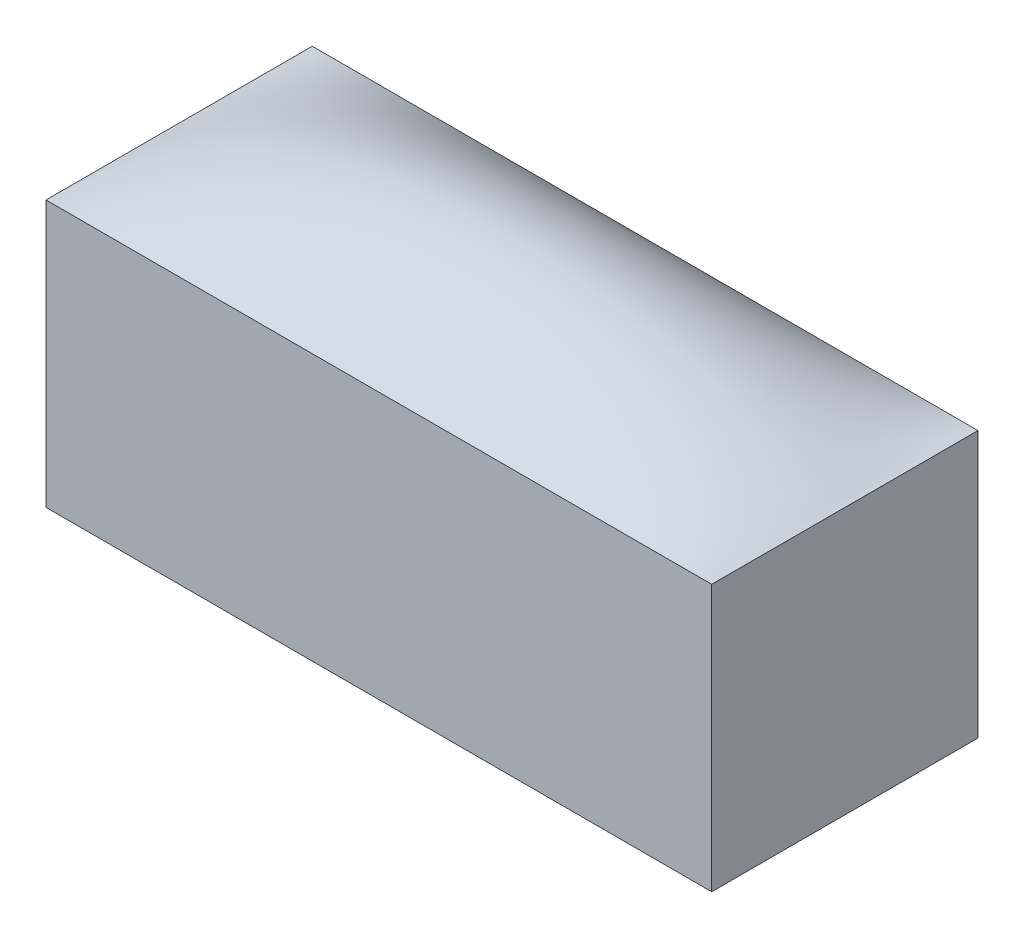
ISO-10303-21;
HEADER;
FILE_DESCRIPTION(('STEP AP214'),'2;1');
FILE_NAME('part.step','',(''),(''),'','','');
FILE_SCHEMA(('AUTOMOTIVE_DESIGN { 1 0 10303 214 1 1 1 1 }'));
ENDSEC;
DATA;
#1=APPLICATION_CONTEXT('core data for automotive mechanical design processes');
#2=APPLICATION_PROTOCOL_DEFINITION('international standard','automotive_design',2000,#1);
#3=PRODUCT_CONTEXT('',#1,'mechanical');
#4=PRODUCT('Part','Part','',(#3));
#5=PRODUCT_RELATED_PRODUCT_CATEGORY('part','',(#4));
#6=PRODUCT_DEFINITION_FORMATION('','',#4);
#7=PRODUCT_DEFINITION_CONTEXT('part definition',#1,'design');
#8=PRODUCT_DEFINITION('design','',#6,#7);
#9=PRODUCT_DEFINITION_SHAPE('','',#8);
#10=(LENGTH_UNIT() NAMED_UNIT(*) SI_UNIT(.MILLI.,.METRE.));
#11=(NAMED_UNIT(*) PLANE_ANGLE_UNIT() SI_UNIT($,.RADIAN.));
#12=(NAMED_UNIT(*) SI_UNIT($,.STERADIAN.) SOLID_ANGLE_UNIT());
#13=UNCERTAINTY_MEASURE_WITH_UNIT(LENGTH_MEASURE(1.E-05),#10,'distance_accuracy_value','');
#14=(GEOMETRIC_REPRESENTATION_CONTEXT(3) GLOBAL_UNCERTAINTY_ASSIGNED_CONTEXT((#13)) GLOBAL_UNIT_ASSIGNED_CONTEXT((#10,
#11,#12)) REPRESENTATION_CONTEXT('',''));
#15=CARTESIAN_POINT('',(0.,0.,0.));
#16=DIRECTION('',(0.,0.,1.));
#17=DIRECTION('',(1.,0.,0.));
#18=AXIS2_PLACEMENT_3D('',#15,#16,#17);
#19=CARTESIAN_POINT('',(20.,8.,-8.));
#20=DIRECTION('',(-1.,0.,0.));
#21=DIRECTION('',(0.,0.,1.));
#22=AXIS2_PLACEMENT_3D('',#19,#20,#21);
#23=PLANE('',#22);
#24=DIRECTION('',(0.,0.,-1.));
#25=VECTOR('',#24,1.);
#26=CARTESIAN_POINT('',(20.,0.,-8.));
#27=LINE('',#26,#25);
#28=CARTESIAN_POINT('',(20.,0.,0.));
#29=VERTEX_POINT('',#28);
#30=CARTESIAN_POINT('',(20.,0.,-8.));
#31=VERTEX_POINT('',#30);
#32=EDGE_CURVE('E87',#29,#31,#27,.T.);
#33=ORIENTED_EDGE('',*,*,#32,.T.);
#34=DIRECTION('',(0.,-1.,0.));
#35=VECTOR('',#34,1.);
#36=CARTESIAN_POINT('',(20.,8.,-8.));
#37=LINE('',#36,#35);
#38=CARTESIAN_POINT('',(20.,8.,-8.));
#39=VERTEX_POINT('',#38);
#40=EDGE_CURVE('E11',#39,#31,#37,.T.);
#41=ORIENTED_EDGE('',*,*,#40,.F.);
#42=DIRECTION('',(0.,0.,-1.));
#43=VECTOR('',#42,1.);
#44=CARTESIAN_POINT('',(20.,8.,-8.));
#45=LINE('',#44,#43);
#46=CARTESIAN_POINT('',(20.,8.,0.));
#47=VERTEX_POINT('',#46);
#48=EDGE_CURVE('E98',#47,#39,#45,.T.);
#49=ORIENTED_EDGE('',*,*,#48,.F.);
#50=DIRECTION('',(0.,-1.,0.));
#51=VECTOR('',#50,1.);
#52=CARTESIAN_POINT('',(20.,8.,0.));
#53=LINE('',#52,#51);
#54=EDGE_CURVE('E93',#47,#29,#53,.T.);
#55=ORIENTED_EDGE('',*,*,#54,.T.);
#56=EDGE_LOOP('',(#33,#41,#49,#55));
#57=FACE_BOUND('',#56,.T.);
#58=ADVANCED_FACE('F31',(#57),#23,.F.);
#59=CARTESIAN_POINT('',(20.,8.,-8.));
#60=DIRECTION('',(0.,0.,1.));
#61=DIRECTION('',(1.,0.,0.));
#62=AXIS2_PLACEMENT_3D('',#59,#60,#61);
#63=PLANE('',#62);
#64=DIRECTION('',(-1.,0.,0.));
#65=VECTOR('',#64,1.);
#66=CARTESIAN_POINT('',(20.,0.,-8.));
#67=LINE('',#66,#65);
#68=CARTESIAN_POINT('',(0.,0.,-8.));
#69=VERTEX_POINT('',#68);
#70=EDGE_CURVE('E84',#31,#69,#67,.T.);
#71=ORIENTED_EDGE('',*,*,#70,.T.);
#72=DIRECTION('',(0.,-1.,0.));
#73=VECTOR('',#72,1.);
#74=CARTESIAN_POINT('',(0.,8.,-8.));
#75=LINE('',#74,#73);
#76=CARTESIAN_POINT('',(0.,8.,-8.));
#77=VERTEX_POINT('',#76);
#78=EDGE_CURVE('E43',#77,#69,#75,.T.);
#79=ORIENTED_EDGE('',*,*,#78,.F.);
#80=DIRECTION('',(-1.,0.,0.));
#81=VECTOR('',#80,1.);
#82=CARTESIAN_POINT('',(20.,8.,-8.));
#83=LINE('',#82,#81);
#84=EDGE_CURVE('E37',#39,#77,#83,.T.);
#85=ORIENTED_EDGE('',*,*,#84,.F.);
#86=ORIENTED_EDGE('',*,*,#40,.T.);
#87=EDGE_LOOP('',(#71,#79,#85,#86));
#88=FACE_BOUND('',#87,.T.);
#89=ADVANCED_FACE('F90',(#88),#63,.F.);
#90=CARTESIAN_POINT('',(0.,8.,-8.));
#91=DIRECTION('',(1.,0.,0.));
#92=DIRECTION('',(0.,0.,-1.));
#93=AXIS2_PLACEMENT_3D('',#90,#91,#92);
#94=PLANE('',#93);
#95=DIRECTION('',(0.,0.,1.));
#96=VECTOR('',#95,1.);
#97=CARTESIAN_POINT('',(0.,0.,-8.));
#98=LINE('',#97,#96);
#99=CARTESIAN_POINT('',(0.,0.,0.));
#100=VERTEX_POINT('',#99);
#101=EDGE_CURVE('E76',#69,#100,#98,.T.);
#102=ORIENTED_EDGE('',*,*,#101,.T.);
#103=DIRECTION('',(0.,-1.,0.));
#104=VECTOR('',#103,1.);
#105=CARTESIAN_POINT('',(0.,8.,0.));
#106=LINE('',#105,#104);
#107=CARTESIAN_POINT('',(0.,8.,0.));
#108=VERTEX_POINT('',#107);
#109=EDGE_CURVE('E100',#108,#100,#106,.T.);
#110=ORIENTED_EDGE('',*,*,#109,.F.);
#111=DIRECTION('',(0.,0.,1.));
#112=VECTOR('',#111,1.);
#113=CARTESIAN_POINT('',(0.,8.,-8.));
#114=LINE('',#113,#112);
#115=EDGE_CURVE('E104',#77,#108,#114,.T.);
#116=ORIENTED_EDGE('',*,*,#115,.F.);
#117=ORIENTED_EDGE('',*,*,#78,.T.);
#118=EDGE_LOOP('',(#102,#110,#116,#117));
#119=FACE_BOUND('',#118,.T.);
#120=ADVANCED_FACE('F106',(#119),#94,.F.);
#121=CARTESIAN_POINT('',(20.,8.,0.));
#122=DIRECTION('',(0.,0.,-1.));
#123=DIRECTION('',(-1.,0.,0.));
#124=AXIS2_PLACEMENT_3D('',#121,#122,#123);
#125=PLANE('',#124);
#126=DIRECTION('',(1.,0.,0.));
#127=VECTOR('',#126,1.);
#128=CARTESIAN_POINT('',(20.,0.,0.));
#129=LINE('',#128,#127);
#130=EDGE_CURVE('E68',#100,#29,#129,.T.);
#131=ORIENTED_EDGE('',*,*,#130,.T.);
#132=ORIENTED_EDGE('',*,*,#54,.F.);
#133=DIRECTION('',(1.,0.,0.));
#134=VECTOR('',#133,1.);
#135=CARTESIAN_POINT('',(20.,8.,0.));
#136=LINE('',#135,#134);
#137=EDGE_CURVE('E52',#108,#47,#136,.T.);
#138=ORIENTED_EDGE('',*,*,#137,.F.);
#139=ORIENTED_EDGE('',*,*,#109,.T.);
#140=EDGE_LOOP('',(#131,#132,#138,#139));
#141=FACE_BOUND('',#140,.T.);
#142=ADVANCED_FACE('F107',(#141),#125,.F.);
#143=CARTESIAN_POINT('',(20.,8.,-8.));
#144=CARTESIAN_POINT('',(13.3333333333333,8.,-8.));
#145=CARTESIAN_POINT('',(6.66666666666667,8.,-8.));
#146=CARTESIAN_POINT('',(0.,8.,-8.));
#147=CARTESIAN_POINT('',(20.,8.,-5.33333333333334));
#148=CARTESIAN_POINT('',(13.3333333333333,11.5555555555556,-5.33333333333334));
#149=CARTESIAN_POINT('',(6.66666666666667,11.5555555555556,-5.33333333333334));
#150=CARTESIAN_POINT('',(0.,8.,-5.33333333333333));
#151=CARTESIAN_POINT('',(20.,8.,-2.66666666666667));
#152=CARTESIAN_POINT('',(13.3333333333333,11.5555555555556,-2.66666666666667));
#153=CARTESIAN_POINT('',(6.66666666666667,11.5555555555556,-2.66666666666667));
#154=CARTESIAN_POINT('',(0.,8.,-2.66666666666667));
#155=CARTESIAN_POINT('',(20.,8.,0.));
#156=CARTESIAN_POINT('',(13.3333333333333,8.,0.));
#157=CARTESIAN_POINT('',(6.66666666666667,8.,0.));
#158=CARTESIAN_POINT('',(0.,8.,0.));
#159=B_SPLINE_SURFACE_WITH_KNOTS('',3,3,((#143,#144,#145,#146),(#147,#148,#149,#150),(#151,#152,
#153,#154),(#155,#156,#157,#158)),.UNSPECIFIED.,.F.,.F.,.F.,(4,4),(4,4),(0.,1.),(0.,1.),.UNSPECIFIED.);
#160=ORIENTED_EDGE('',*,*,#48,.T.);
#161=ORIENTED_EDGE('',*,*,#84,.T.);
#162=ORIENTED_EDGE('',*,*,#115,.T.);
#163=ORIENTED_EDGE('',*,*,#137,.T.);
#164=EDGE_LOOP('',(#160,#161,#162,#163));
#165=FACE_BOUND('',#164,.T.);
#166=ADVANCED_FACE('F33',(#165),#159,.F.);
#167=CARTESIAN_POINT('',(20.,0.,0.));
#168=DIRECTION('',(0.,-1.,0.));
#169=DIRECTION('',(0.,0.,-1.));
#170=AXIS2_PLACEMENT_3D('',#167,#168,#169);
#171=PLANE('',#170);
#172=ORIENTED_EDGE('',*,*,#32,.F.);
#173=ORIENTED_EDGE('',*,*,#130,.F.);
#174=ORIENTED_EDGE('',*,*,#101,.F.);
#175=ORIENTED_EDGE('',*,*,#70,.F.);
#176=EDGE_LOOP('',(#172,#173,#174,#175));
#177=FACE_BOUND('',#176,.T.);
#178=ADVANCED_FACE('F85',(#177),#171,.T.);
#179=CLOSED_SHELL('',(#58,#89,#120,#142,#166,#178));
#180=MANIFOLD_SOLID_BREP('B2',#179);
#181=ADVANCED_BREP_SHAPE_REPRESENTATION('',(#18,#180),#14);
#182=SHAPE_DEFINITION_REPRESENTATION(#9,#181);
ENDSEC;
END-ISO-10303-21;
